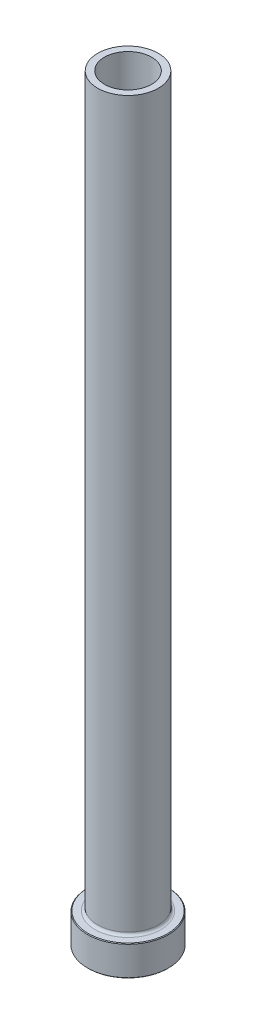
from build123d import *

# Parameters (mm, degrees)
FILLET1_R     = 0.8
CHAMFER1_SIZE = 0.2
CHAMFER3_SIZE = 0.5


with BuildPart() as part:
    # Sketch1 → Revolve1 (revolve)
    with BuildSketch(Plane.XY, mode=Mode.PRIVATE) as revolve1_sk:
        Polygon((-7, 225), (-9, 225), (-9, 9), (-12, 9), (-12, 0), (-7.25, 0), (-7.25, 158), (-7, 170), align=None)
    revolve(revolve1_sk.sketch.rotate(Axis((0, 92.187680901, 0), (0, -1, 0)), 270), axis=Axis((0, 92.187680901, 0), (0, -1, 0)))

    # Fillet1
    fillet1_edges = [part.edges().sort_by_distance(p)[0] for p in [
        (0, 9, -9),
    ]]
    fillet(fillet1_edges, radius=FILLET1_R)

    # Chamfer1
    chamfer1_edges = [part.edges().sort_by_distance(p)[0] for p in [
        (0, 0, -12),
        (0, 9, -12),
    ]]
    chamfer(chamfer1_edges, length=CHAMFER1_SIZE)

    # Chamfer3
    chamfer3_edges = [part.edges().sort_by_distance(p)[0] for p in [
        (0, 0, -7.25),
    ]]
    chamfer(chamfer3_edges, length=CHAMFER3_SIZE)


solid = part.part
